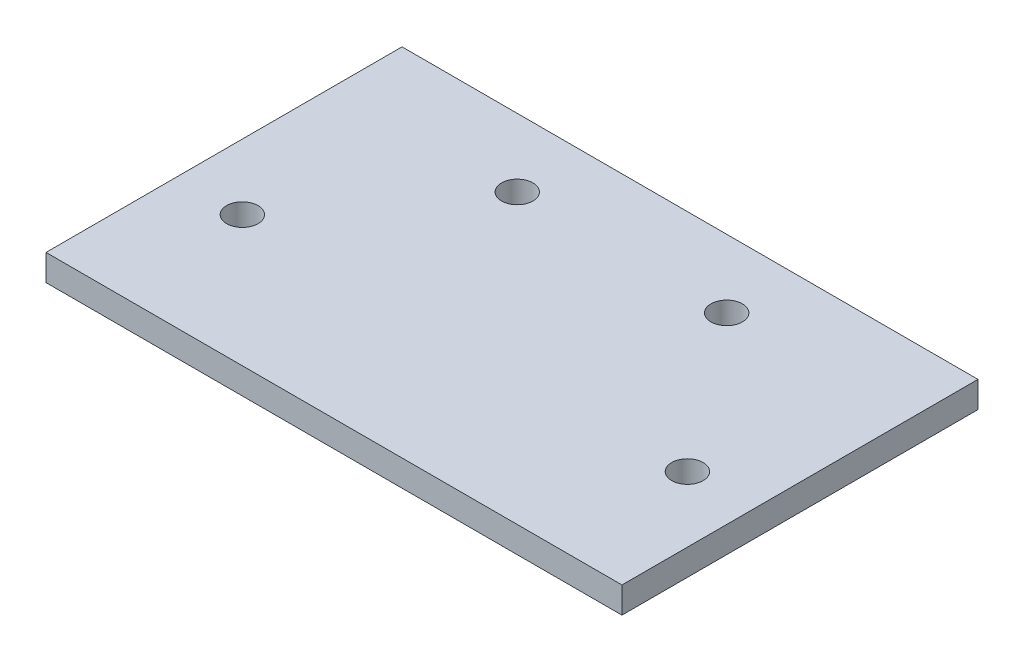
from build123d import *

# Parameters (mm, degrees)
SKETCH1_W      = 110
SKETCH1_H      = 68
SKETCH1_R      = 3
EXTRUDE1_DEPTH = 5


with BuildPart() as part:
    # Sketch1 → Extrude1 (new body)
    with BuildSketch(Plane(origin=(0, 0, 0), x_dir=(1, 0, 0), z_dir=(0, 1, 0))):
        with Locations((55, 34)):
            Rectangle(SKETCH1_W, SKETCH1_H)
        with Locations(Location((35, 55, 0), (0, 0, 270))):
            Circle(SKETCH1_R, mode=Mode.SUBTRACT)
        with Locations(Location((75, 55, 0), (0, 0, 270))):
            Circle(SKETCH1_R, mode=Mode.SUBTRACT)
        with Locations(Location((12.5, 25, 0), (0, 0, 270))):
            Circle(SKETCH1_R, mode=Mode.SUBTRACT)
        with Locations(Location((97.5, 25, 0), (0, 0, 270))):
            Circle(SKETCH1_R, mode=Mode.SUBTRACT)
    extrude(amount=EXTRUDE1_DEPTH)


solid = part.part
